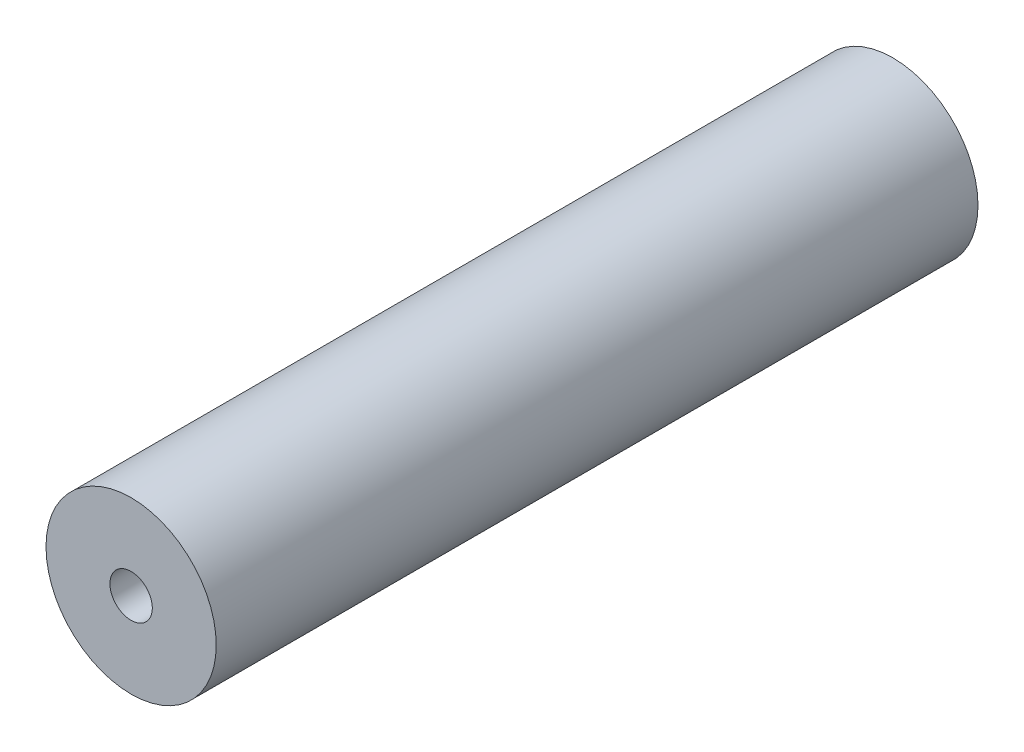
ISO-10303-21;
HEADER;
FILE_DESCRIPTION(('STEP AP214'),'2;1');
FILE_NAME('part.step','',(''),(''),'','','');
FILE_SCHEMA(('AUTOMOTIVE_DESIGN { 1 0 10303 214 1 1 1 1 }'));
ENDSEC;
DATA;
#1=APPLICATION_CONTEXT('core data for automotive mechanical design processes');
#2=APPLICATION_PROTOCOL_DEFINITION('international standard','automotive_design',2000,#1);
#3=PRODUCT_CONTEXT('',#1,'mechanical');
#4=PRODUCT('Part','Part','',(#3));
#5=PRODUCT_RELATED_PRODUCT_CATEGORY('part','',(#4));
#6=PRODUCT_DEFINITION_FORMATION('','',#4);
#7=PRODUCT_DEFINITION_CONTEXT('part definition',#1,'design');
#8=PRODUCT_DEFINITION('design','',#6,#7);
#9=PRODUCT_DEFINITION_SHAPE('','',#8);
#10=(LENGTH_UNIT() NAMED_UNIT(*) SI_UNIT(.MILLI.,.METRE.));
#11=(NAMED_UNIT(*) PLANE_ANGLE_UNIT() SI_UNIT($,.RADIAN.));
#12=(NAMED_UNIT(*) SI_UNIT($,.STERADIAN.) SOLID_ANGLE_UNIT());
#13=UNCERTAINTY_MEASURE_WITH_UNIT(LENGTH_MEASURE(1.E-05),#10,'distance_accuracy_value','');
#14=(GEOMETRIC_REPRESENTATION_CONTEXT(3) GLOBAL_UNCERTAINTY_ASSIGNED_CONTEXT((#13)) GLOBAL_UNIT_ASSIGNED_CONTEXT((#10,
#11,#12)) REPRESENTATION_CONTEXT('',''));
#15=CARTESIAN_POINT('',(0.,0.,0.));
#16=DIRECTION('',(0.,0.,1.));
#17=DIRECTION('',(1.,0.,0.));
#18=AXIS2_PLACEMENT_3D('',#15,#16,#17);
#19=CARTESIAN_POINT('',(229.226497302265,-84.2000000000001,89.5));
#20=DIRECTION('',(0.,0.,-1.));
#21=DIRECTION('',(-1.,0.,0.));
#22=AXIS2_PLACEMENT_3D('',#19,#20,#21);
#23=CYLINDRICAL_SURFACE('',#22,2.4892);
#24=CARTESIAN_POINT('',(229.226497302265,-84.2000000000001,89.5));
#25=DIRECTION('',(0.,0.,1.));
#26=DIRECTION('',(1.,0.,0.));
#27=AXIS2_PLACEMENT_3D('',#24,#25,#26);
#28=CIRCLE('',#27,2.4892);
#29=CARTESIAN_POINT('',(226.737297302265,-84.2000000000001,89.5));
#30=VERTEX_POINT('',#29);
#31=EDGE_CURVE('E44',#30,#30,#28,.T.);
#32=CARTESIAN_POINT('',(229.226497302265,-84.2000000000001,0.));
#33=DIRECTION('',(0.,0.,1.));
#34=DIRECTION('',(1.,0.,0.));
#35=AXIS2_PLACEMENT_3D('',#32,#33,#34);
#36=CIRCLE('',#35,2.4892);
#37=CARTESIAN_POINT('',(226.737297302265,-84.2000000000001,0.));
#38=VERTEX_POINT('',#37);
#39=EDGE_CURVE('E50',#38,#38,#36,.T.);
#40=CARTESIAN_POINT('',(226.737297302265,-84.2000000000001,89.5));
#41=CARTESIAN_POINT('',(226.737297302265,-84.2000000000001,88.5677083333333));
#42=CARTESIAN_POINT('',(226.737297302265,-84.2000000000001,87.6354166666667));
#43=CARTESIAN_POINT('',(226.737297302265,-84.2000000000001,85.7708333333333));
#44=CARTESIAN_POINT('',(226.737297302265,-84.2000000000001,84.8385416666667));
#45=CARTESIAN_POINT('',(226.737297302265,-84.2000000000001,82.9739583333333));
#46=CARTESIAN_POINT('',(226.737297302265,-84.2000000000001,82.0416666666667));
#47=CARTESIAN_POINT('',(226.737297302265,-84.2000000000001,80.1770833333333));
#48=CARTESIAN_POINT('',(226.737297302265,-84.2000000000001,79.2447916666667));
#49=CARTESIAN_POINT('',(226.737297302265,-84.2000000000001,77.3802083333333));
#50=CARTESIAN_POINT('',(226.737297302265,-84.2000000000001,76.4479166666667));
#51=CARTESIAN_POINT('',(226.737297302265,-84.2000000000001,74.5833333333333));
#52=CARTESIAN_POINT('',(226.737297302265,-84.2000000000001,73.6510416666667));
#53=CARTESIAN_POINT('',(226.737297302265,-84.2000000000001,71.7864583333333));
#54=CARTESIAN_POINT('',(226.737297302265,-84.2000000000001,70.8541666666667));
#55=CARTESIAN_POINT('',(226.737297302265,-84.2000000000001,68.9895833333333));
#56=CARTESIAN_POINT('',(226.737297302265,-84.2000000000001,68.0572916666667));
#57=CARTESIAN_POINT('',(226.737297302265,-84.2000000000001,66.1927083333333));
#58=CARTESIAN_POINT('',(226.737297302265,-84.2000000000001,65.2604166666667));
#59=CARTESIAN_POINT('',(226.737297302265,-84.2000000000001,63.3958333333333));
#60=CARTESIAN_POINT('',(226.737297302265,-84.2000000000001,62.4635416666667));
#61=CARTESIAN_POINT('',(226.737297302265,-84.2000000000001,60.5989583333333));
#62=CARTESIAN_POINT('',(226.737297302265,-84.2000000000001,59.6666666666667));
#63=CARTESIAN_POINT('',(226.737297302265,-84.2000000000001,57.8020833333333));
#64=CARTESIAN_POINT('',(226.737297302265,-84.2000000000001,56.8697916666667));
#65=CARTESIAN_POINT('',(226.737297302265,-84.2000000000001,55.0052083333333));
#66=CARTESIAN_POINT('',(226.737297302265,-84.2000000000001,54.0729166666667));
#67=CARTESIAN_POINT('',(226.737297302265,-84.2000000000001,52.2083333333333));
#68=CARTESIAN_POINT('',(226.737297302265,-84.2000000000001,51.2760416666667));
#69=CARTESIAN_POINT('',(226.737297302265,-84.2000000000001,49.4114583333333));
#70=CARTESIAN_POINT('',(226.737297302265,-84.2000000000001,48.4791666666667));
#71=CARTESIAN_POINT('',(226.737297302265,-84.2000000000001,46.6145833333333));
#72=CARTESIAN_POINT('',(226.737297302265,-84.2000000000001,45.6822916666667));
#73=CARTESIAN_POINT('',(226.737297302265,-84.2000000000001,43.8177083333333));
#74=CARTESIAN_POINT('',(226.737297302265,-84.2000000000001,42.8854166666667));
#75=CARTESIAN_POINT('',(226.737297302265,-84.2000000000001,41.0208333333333));
#76=CARTESIAN_POINT('',(226.737297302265,-84.2000000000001,40.0885416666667));
#77=CARTESIAN_POINT('',(226.737297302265,-84.2000000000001,38.2239583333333));
#78=CARTESIAN_POINT('',(226.737297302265,-84.2000000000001,37.2916666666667));
#79=CARTESIAN_POINT('',(226.737297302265,-84.2000000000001,35.4270833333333));
#80=CARTESIAN_POINT('',(226.737297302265,-84.2000000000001,34.4947916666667));
#81=CARTESIAN_POINT('',(226.737297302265,-84.2000000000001,32.6302083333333));
#82=CARTESIAN_POINT('',(226.737297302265,-84.2000000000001,31.6979166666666));
#83=CARTESIAN_POINT('',(226.737297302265,-84.2000000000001,29.8333333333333));
#84=CARTESIAN_POINT('',(226.737297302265,-84.2000000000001,28.9010416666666));
#85=CARTESIAN_POINT('',(226.737297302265,-84.2000000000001,27.0364583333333));
#86=CARTESIAN_POINT('',(226.737297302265,-84.2000000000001,26.1041666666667));
#87=CARTESIAN_POINT('',(226.737297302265,-84.2000000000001,24.2395833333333));
#88=CARTESIAN_POINT('',(226.737297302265,-84.2000000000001,23.3072916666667));
#89=CARTESIAN_POINT('',(226.737297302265,-84.2000000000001,21.4427083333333));
#90=CARTESIAN_POINT('',(226.737297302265,-84.2000000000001,20.5104166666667));
#91=CARTESIAN_POINT('',(226.737297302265,-84.2000000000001,18.6458333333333));
#92=CARTESIAN_POINT('',(226.737297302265,-84.2000000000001,17.7135416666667));
#93=CARTESIAN_POINT('',(226.737297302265,-84.2000000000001,15.8489583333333));
#94=CARTESIAN_POINT('',(226.737297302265,-84.2000000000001,14.9166666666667));
#95=CARTESIAN_POINT('',(226.737297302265,-84.2000000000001,13.0520833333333));
#96=CARTESIAN_POINT('',(226.737297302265,-84.2000000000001,12.1197916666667));
#97=CARTESIAN_POINT('',(226.737297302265,-84.2000000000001,10.2552083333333));
#98=CARTESIAN_POINT('',(226.737297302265,-84.2000000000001,9.32291666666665));
#99=CARTESIAN_POINT('',(226.737297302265,-84.2000000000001,7.45833333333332));
#100=CARTESIAN_POINT('',(226.737297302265,-84.2000000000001,6.52604166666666));
#101=CARTESIAN_POINT('',(226.737297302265,-84.2000000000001,4.66145833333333));
#102=CARTESIAN_POINT('',(226.737297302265,-84.2000000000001,3.72916666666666));
#103=CARTESIAN_POINT('',(226.737297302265,-84.2000000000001,1.86458333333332));
#104=CARTESIAN_POINT('',(226.737297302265,-84.2000000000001,0.932291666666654));
#105=CARTESIAN_POINT('',(226.737297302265,-84.2000000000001,0.));
#106=B_SPLINE_CURVE_WITH_KNOTS('',3,(#40,#41,#42,#43,#44,#45,#46,#47,#48,#49,#50,#51,#52,#53,
#54,#55,#56,#57,#58,#59,#60,#61,#62,#63,#64,#65,#66,#67,#68,#69,#70,#71,#72,#73,#74,#75,#76,#77,
#78,#79,#80,#81,#82,#83,#84,#85,#86,#87,#88,#89,#90,#91,#92,#93,#94,#95,#96,#97,#98,#99,#100,
#101,#102,#103,#104,#105),.UNSPECIFIED.,.F.,.F.,(4,2,2,2,2,2,2,2,2,2,2,2,2,2,2,2,2,2,2,2,2,2,2,
2,2,2,2,2,2,2,2,2,4),(0.,2.796875,5.59375000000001,8.39062500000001,11.1875,13.984375,16.78125,
19.578125,22.375,25.171875,27.96875,30.765625,33.5625,36.359375,39.15625,41.953125,44.75,
47.546875,50.34375,53.140625,55.9375,58.734375,61.53125,64.328125,67.125,69.921875,72.71875,
75.515625,78.3125,81.109375,83.90625,86.703125,89.5),.UNSPECIFIED.);
#107=EDGE_CURVE('BSEAM37',#30,#38,#106,.T.);
#108=ORIENTED_EDGE('',*,*,#31,.T.);
#109=ORIENTED_EDGE('',*,*,#39,.F.);
#110=ORIENTED_EDGE('',*,*,#107,.T.);
#111=ORIENTED_EDGE('',*,*,#107,.F.);
#112=EDGE_LOOP('',(#108,#110,#109,#111));
#113=FACE_BOUND('',#112,.T.);
#114=ADVANCED_FACE('F37',(#113),#23,.F.);
#115=CARTESIAN_POINT('',(229.226497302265,-84.2000000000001,89.5));
#116=DIRECTION('',(0.,0.,-1.));
#117=DIRECTION('',(-1.,0.,0.));
#118=AXIS2_PLACEMENT_3D('',#115,#116,#117);
#119=CYLINDRICAL_SURFACE('',#118,10.);
#120=CARTESIAN_POINT('',(229.226497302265,-84.2000000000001,89.5));
#121=DIRECTION('',(0.,0.,1.));
#122=DIRECTION('',(1.,0.,0.));
#123=AXIS2_PLACEMENT_3D('',#120,#121,#122);
#124=CIRCLE('',#123,10.);
#125=CARTESIAN_POINT('',(219.226497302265,-84.2000000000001,89.5));
#126=VERTEX_POINT('',#125);
#127=EDGE_CURVE('E10',#126,#126,#124,.T.);
#128=CARTESIAN_POINT('',(229.226497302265,-84.2000000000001,0.));
#129=DIRECTION('',(0.,0.,1.));
#130=DIRECTION('',(1.,0.,0.));
#131=AXIS2_PLACEMENT_3D('',#128,#129,#130);
#132=CIRCLE('',#131,10.);
#133=CARTESIAN_POINT('',(219.226497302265,-84.2000000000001,0.));
#134=VERTEX_POINT('',#133);
#135=EDGE_CURVE('E40',#134,#134,#132,.T.);
#136=CARTESIAN_POINT('',(219.226497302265,-84.2000000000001,89.5));
#137=CARTESIAN_POINT('',(219.226497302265,-84.2000000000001,88.5677083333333));
#138=CARTESIAN_POINT('',(219.226497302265,-84.2000000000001,87.6354166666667));
#139=CARTESIAN_POINT('',(219.226497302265,-84.2000000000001,85.7708333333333));
#140=CARTESIAN_POINT('',(219.226497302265,-84.2000000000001,84.8385416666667));
#141=CARTESIAN_POINT('',(219.226497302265,-84.2000000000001,82.9739583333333));
#142=CARTESIAN_POINT('',(219.226497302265,-84.2000000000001,82.0416666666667));
#143=CARTESIAN_POINT('',(219.226497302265,-84.2000000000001,80.1770833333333));
#144=CARTESIAN_POINT('',(219.226497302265,-84.2000000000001,79.2447916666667));
#145=CARTESIAN_POINT('',(219.226497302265,-84.2000000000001,77.3802083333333));
#146=CARTESIAN_POINT('',(219.226497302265,-84.2000000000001,76.4479166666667));
#147=CARTESIAN_POINT('',(219.226497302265,-84.2000000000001,74.5833333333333));
#148=CARTESIAN_POINT('',(219.226497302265,-84.2000000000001,73.6510416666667));
#149=CARTESIAN_POINT('',(219.226497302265,-84.2000000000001,71.7864583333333));
#150=CARTESIAN_POINT('',(219.226497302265,-84.2000000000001,70.8541666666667));
#151=CARTESIAN_POINT('',(219.226497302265,-84.2000000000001,68.9895833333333));
#152=CARTESIAN_POINT('',(219.226497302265,-84.2000000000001,68.0572916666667));
#153=CARTESIAN_POINT('',(219.226497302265,-84.2000000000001,66.1927083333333));
#154=CARTESIAN_POINT('',(219.226497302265,-84.2000000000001,65.2604166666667));
#155=CARTESIAN_POINT('',(219.226497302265,-84.2000000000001,63.3958333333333));
#156=CARTESIAN_POINT('',(219.226497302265,-84.2000000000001,62.4635416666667));
#157=CARTESIAN_POINT('',(219.226497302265,-84.2000000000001,60.5989583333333));
#158=CARTESIAN_POINT('',(219.226497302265,-84.2000000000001,59.6666666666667));
#159=CARTESIAN_POINT('',(219.226497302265,-84.2000000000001,57.8020833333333));
#160=CARTESIAN_POINT('',(219.226497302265,-84.2000000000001,56.8697916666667));
#161=CARTESIAN_POINT('',(219.226497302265,-84.2000000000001,55.0052083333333));
#162=CARTESIAN_POINT('',(219.226497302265,-84.2000000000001,54.0729166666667));
#163=CARTESIAN_POINT('',(219.226497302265,-84.2000000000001,52.2083333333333));
#164=CARTESIAN_POINT('',(219.226497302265,-84.2000000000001,51.2760416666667));
#165=CARTESIAN_POINT('',(219.226497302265,-84.2000000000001,49.4114583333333));
#166=CARTESIAN_POINT('',(219.226497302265,-84.2000000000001,48.4791666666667));
#167=CARTESIAN_POINT('',(219.226497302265,-84.2000000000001,46.6145833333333));
#168=CARTESIAN_POINT('',(219.226497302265,-84.2000000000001,45.6822916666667));
#169=CARTESIAN_POINT('',(219.226497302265,-84.2000000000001,43.8177083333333));
#170=CARTESIAN_POINT('',(219.226497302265,-84.2000000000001,42.8854166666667));
#171=CARTESIAN_POINT('',(219.226497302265,-84.2000000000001,41.0208333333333));
#172=CARTESIAN_POINT('',(219.226497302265,-84.2000000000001,40.0885416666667));
#173=CARTESIAN_POINT('',(219.226497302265,-84.2000000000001,38.2239583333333));
#174=CARTESIAN_POINT('',(219.226497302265,-84.2000000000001,37.2916666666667));
#175=CARTESIAN_POINT('',(219.226497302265,-84.2000000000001,35.4270833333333));
#176=CARTESIAN_POINT('',(219.226497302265,-84.2000000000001,34.4947916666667));
#177=CARTESIAN_POINT('',(219.226497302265,-84.2000000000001,32.6302083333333));
#178=CARTESIAN_POINT('',(219.226497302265,-84.2000000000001,31.6979166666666));
#179=CARTESIAN_POINT('',(219.226497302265,-84.2000000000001,29.8333333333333));
#180=CARTESIAN_POINT('',(219.226497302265,-84.2000000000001,28.9010416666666));
#181=CARTESIAN_POINT('',(219.226497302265,-84.2000000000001,27.0364583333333));
#182=CARTESIAN_POINT('',(219.226497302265,-84.2000000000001,26.1041666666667));
#183=CARTESIAN_POINT('',(219.226497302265,-84.2000000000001,24.2395833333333));
#184=CARTESIAN_POINT('',(219.226497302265,-84.2000000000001,23.3072916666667));
#185=CARTESIAN_POINT('',(219.226497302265,-84.2000000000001,21.4427083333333));
#186=CARTESIAN_POINT('',(219.226497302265,-84.2000000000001,20.5104166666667));
#187=CARTESIAN_POINT('',(219.226497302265,-84.2000000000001,18.6458333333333));
#188=CARTESIAN_POINT('',(219.226497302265,-84.2000000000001,17.7135416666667));
#189=CARTESIAN_POINT('',(219.226497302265,-84.2000000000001,15.8489583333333));
#190=CARTESIAN_POINT('',(219.226497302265,-84.2000000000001,14.9166666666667));
#191=CARTESIAN_POINT('',(219.226497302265,-84.2000000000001,13.0520833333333));
#192=CARTESIAN_POINT('',(219.226497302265,-84.2000000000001,12.1197916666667));
#193=CARTESIAN_POINT('',(219.226497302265,-84.2000000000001,10.2552083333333));
#194=CARTESIAN_POINT('',(219.226497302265,-84.2000000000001,9.32291666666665));
#195=CARTESIAN_POINT('',(219.226497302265,-84.2000000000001,7.45833333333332));
#196=CARTESIAN_POINT('',(219.226497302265,-84.2000000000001,6.52604166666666));
#197=CARTESIAN_POINT('',(219.226497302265,-84.2000000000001,4.66145833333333));
#198=CARTESIAN_POINT('',(219.226497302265,-84.2000000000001,3.72916666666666));
#199=CARTESIAN_POINT('',(219.226497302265,-84.2000000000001,1.86458333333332));
#200=CARTESIAN_POINT('',(219.226497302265,-84.2000000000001,0.932291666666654));
#201=CARTESIAN_POINT('',(219.226497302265,-84.2000000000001,0.));
#202=B_SPLINE_CURVE_WITH_KNOTS('',3,(#136,#137,#138,#139,#140,#141,#142,#143,#144,#145,#146,
#147,#148,#149,#150,#151,#152,#153,#154,#155,#156,#157,#158,#159,#160,#161,#162,#163,#164,#165,
#166,#167,#168,#169,#170,#171,#172,#173,#174,#175,#176,#177,#178,#179,#180,#181,#182,#183,#184,
#185,#186,#187,#188,#189,#190,#191,#192,#193,#194,#195,#196,#197,#198,#199,#200,#201),
.UNSPECIFIED.,.F.,.F.,(4,2,2,2,2,2,2,2,2,2,2,2,2,2,2,2,2,2,2,2,2,2,2,2,2,2,2,2,2,2,2,2,4),(0.,
2.796875,5.59375000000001,8.39062500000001,11.1875,13.984375,16.78125,19.578125,22.375,
25.171875,27.96875,30.765625,33.5625,36.359375,39.15625,41.953125,44.75,47.546875,50.34375,
53.140625,55.9375,58.734375,61.53125,64.328125,67.125,69.921875,72.71875,75.515625,78.3125,
81.109375,83.90625,86.703125,89.5),.UNSPECIFIED.);
#203=EDGE_CURVE('BSEAM57',#126,#134,#202,.T.);
#204=ORIENTED_EDGE('',*,*,#127,.F.);
#205=ORIENTED_EDGE('',*,*,#135,.T.);
#206=ORIENTED_EDGE('',*,*,#203,.T.);
#207=ORIENTED_EDGE('',*,*,#203,.F.);
#208=EDGE_LOOP('',(#204,#206,#205,#207));
#209=FACE_BOUND('',#208,.T.);
#210=ADVANCED_FACE('F57',(#209),#119,.T.);
#211=CARTESIAN_POINT('',(0.,0.,89.5));
#212=DIRECTION('',(0.,0.,1.));
#213=DIRECTION('',(1.,0.,0.));
#214=AXIS2_PLACEMENT_3D('',#211,#212,#213);
#215=PLANE('',#214);
#216=ORIENTED_EDGE('',*,*,#31,.F.);
#217=EDGE_LOOP('',(#216));
#218=FACE_BOUND('',#217,.T.);
#219=ORIENTED_EDGE('',*,*,#127,.T.);
#220=EDGE_LOOP('',(#219));
#221=FACE_BOUND('',#220,.T.);
#222=ADVANCED_FACE('F61',(#218,#221),#215,.T.);
#223=CARTESIAN_POINT('',(0.,0.,0.));
#224=DIRECTION('',(0.,0.,1.));
#225=DIRECTION('',(1.,0.,0.));
#226=AXIS2_PLACEMENT_3D('',#223,#224,#225);
#227=PLANE('',#226);
#228=ORIENTED_EDGE('',*,*,#39,.T.);
#229=EDGE_LOOP('',(#228));
#230=FACE_BOUND('',#229,.T.);
#231=ORIENTED_EDGE('',*,*,#135,.F.);
#232=EDGE_LOOP('',(#231));
#233=FACE_BOUND('',#232,.T.);
#234=ADVANCED_FACE('F59',(#230,#233),#227,.F.);
#235=CLOSED_SHELL('',(#114,#210,#222,#234));
#236=MANIFOLD_SOLID_BREP('B2',#235);
#237=ADVANCED_BREP_SHAPE_REPRESENTATION('',(#18,#236),#14);
#238=SHAPE_DEFINITION_REPRESENTATION(#9,#237);
ENDSEC;
END-ISO-10303-21;
